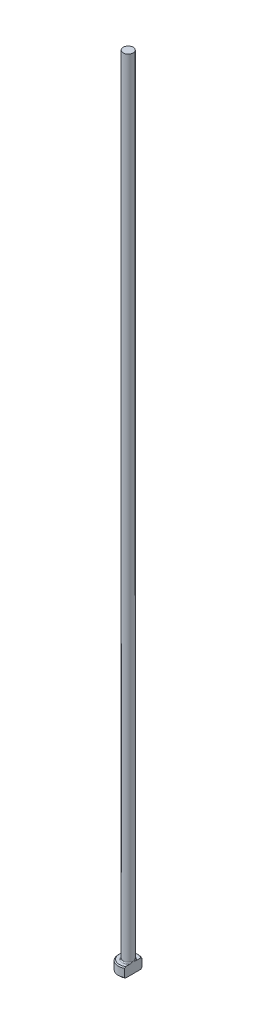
ISO-10303-21;
HEADER;
FILE_DESCRIPTION(('STEP AP214'),'2;1');
FILE_NAME('part.step','',(''),(''),'','','');
FILE_SCHEMA(('AUTOMOTIVE_DESIGN { 1 0 10303 214 1 1 1 1 }'));
ENDSEC;
DATA;
#1=APPLICATION_CONTEXT('core data for automotive mechanical design processes');
#2=APPLICATION_PROTOCOL_DEFINITION('international standard','automotive_design',2000,#1);
#3=PRODUCT_CONTEXT('',#1,'mechanical');
#4=PRODUCT('Part','Part','',(#3));
#5=PRODUCT_RELATED_PRODUCT_CATEGORY('part','',(#4));
#6=PRODUCT_DEFINITION_FORMATION('','',#4);
#7=PRODUCT_DEFINITION_CONTEXT('part definition',#1,'design');
#8=PRODUCT_DEFINITION('design','',#6,#7);
#9=PRODUCT_DEFINITION_SHAPE('','',#8);
#10=(LENGTH_UNIT() NAMED_UNIT(*) SI_UNIT(.MILLI.,.METRE.));
#11=(NAMED_UNIT(*) PLANE_ANGLE_UNIT() SI_UNIT($,.RADIAN.));
#12=(NAMED_UNIT(*) SI_UNIT($,.STERADIAN.) SOLID_ANGLE_UNIT());
#13=UNCERTAINTY_MEASURE_WITH_UNIT(LENGTH_MEASURE(1.E-05),#10,'distance_accuracy_value','');
#14=(GEOMETRIC_REPRESENTATION_CONTEXT(3) GLOBAL_UNCERTAINTY_ASSIGNED_CONTEXT((#13)) GLOBAL_UNIT_ASSIGNED_CONTEXT((#10,
#11,#12)) REPRESENTATION_CONTEXT('',''));
#15=CARTESIAN_POINT('',(0.,0.,0.));
#16=DIRECTION('',(0.,0.,1.));
#17=DIRECTION('',(1.,0.,0.));
#18=AXIS2_PLACEMENT_3D('',#15,#16,#17);
#19=CARTESIAN_POINT('',(0.,0.,0.));
#20=DIRECTION('',(0.,-1.,0.));
#21=DIRECTION('',(0.,0.,-1.));
#22=AXIS2_PLACEMENT_3D('',#19,#20,#21);
#23=PLANE('',#22);
#24=CARTESIAN_POINT('',(0.,0.,0.));
#25=DIRECTION('',(0.,-1.,0.));
#26=DIRECTION('',(0.,0.,-1.));
#27=AXIS2_PLACEMENT_3D('',#24,#25,#26);
#28=CIRCLE('',#27,1.79999999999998);
#29=CARTESIAN_POINT('',(0.999999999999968,0.,1.49666295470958));
#30=VERTEX_POINT('',#29);
#31=CARTESIAN_POINT('',(0.999999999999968,0.,-1.49666295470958));
#32=VERTEX_POINT('',#31);
#33=EDGE_CURVE('E98',#30,#32,#28,.T.);
#34=ORIENTED_EDGE('',*,*,#33,.T.);
#35=DIRECTION('',(0.,0.,1.));
#36=VECTOR('',#35,1.);
#37=CARTESIAN_POINT('',(0.999999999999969,0.,-1.73205080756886));
#38=LINE('',#37,#36);
#39=EDGE_CURVE('E83',#32,#30,#38,.T.);
#40=ORIENTED_EDGE('',*,*,#39,.T.);
#41=EDGE_LOOP('',(#34,#40));
#42=FACE_BOUND('',#41,.T.);
#43=ADVANCED_FACE('F32',(#42),#23,.T.);
#44=CARTESIAN_POINT('',(0.,259.958771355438,0.));
#45=DIRECTION('',(0.,1.,0.));
#46=DIRECTION('',(0.,0.,1.));
#47=AXIS2_PLACEMENT_3D('',#44,#45,#46);
#48=CYLINDRICAL_SURFACE('',#47,1.99999999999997);
#49=CARTESIAN_POINT('',(0.,1.79999999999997,0.));
#50=DIRECTION('',(0.,1.,0.));
#51=DIRECTION('',(0.,0.,1.));
#52=AXIS2_PLACEMENT_3D('',#49,#50,#51);
#53=CIRCLE('',#52,1.99999999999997);
#54=CARTESIAN_POINT('',(0.999999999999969,1.79999999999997,1.73205080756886));
#55=VERTEX_POINT('',#54);
#56=CARTESIAN_POINT('',(0.999999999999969,1.79999999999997,-1.73205080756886));
#57=VERTEX_POINT('',#56);
#58=EDGE_CURVE('E104',#55,#57,#53,.F.);
#59=ORIENTED_EDGE('',*,*,#58,.T.);
#60=DIRECTION('',(0.,-1.,0.));
#61=VECTOR('',#60,1.);
#62=CARTESIAN_POINT('',(0.999999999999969,160.,-1.73205080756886));
#63=LINE('',#62,#61);
#64=CARTESIAN_POINT('',(0.999999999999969,0.199999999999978,-1.73205080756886));
#65=VERTEX_POINT('',#64);
#66=EDGE_CURVE('E183',#57,#65,#63,.T.);
#67=ORIENTED_EDGE('',*,*,#66,.T.);
#68=CARTESIAN_POINT('',(0.,0.199999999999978,0.));
#69=DIRECTION('',(0.,-1.,0.));
#70=DIRECTION('',(0.,0.,-1.));
#71=AXIS2_PLACEMENT_3D('',#68,#69,#70);
#72=CIRCLE('',#71,1.99999999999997);
#73=CARTESIAN_POINT('',(0.999999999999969,0.199999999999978,1.73205080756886));
#74=VERTEX_POINT('',#73);
#75=EDGE_CURVE('E100',#65,#74,#72,.F.);
#76=ORIENTED_EDGE('',*,*,#75,.T.);
#77=DIRECTION('',(0.,-1.,0.));
#78=VECTOR('',#77,1.);
#79=CARTESIAN_POINT('',(0.999999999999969,160.,1.73205080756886));
#80=LINE('',#79,#78);
#81=EDGE_CURVE('E93',#55,#74,#80,.T.);
#82=ORIENTED_EDGE('',*,*,#81,.F.);
#83=EDGE_LOOP('',(#59,#67,#76,#82));
#84=FACE_BOUND('',#83,.T.);
#85=ADVANCED_FACE('F158',(#84),#48,.T.);
#86=CARTESIAN_POINT('',(-1.99999999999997,2.,0.));
#87=DIRECTION('',(0.,1.,0.));
#88=DIRECTION('',(0.,0.,1.));
#89=AXIS2_PLACEMENT_3D('',#86,#87,#88);
#90=PLANE('',#89);
#91=CARTESIAN_POINT('',(0.,2.,0.));
#92=DIRECTION('',(0.,1.,0.));
#93=DIRECTION('',(0.,0.,1.));
#94=AXIS2_PLACEMENT_3D('',#91,#92,#93);
#95=CIRCLE('',#94,1.79999999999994);
#96=CARTESIAN_POINT('',(0.999999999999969,2.,-1.49666295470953));
#97=VERTEX_POINT('',#96);
#98=CARTESIAN_POINT('',(0.999999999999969,2.,1.49666295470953));
#99=VERTEX_POINT('',#98);
#100=EDGE_CURVE('E178',#97,#99,#95,.T.);
#101=ORIENTED_EDGE('',*,*,#100,.T.);
#102=DIRECTION('',(0.,0.,-1.));
#103=VECTOR('',#102,1.);
#104=CARTESIAN_POINT('',(0.999999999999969,2.,0.));
#105=LINE('',#104,#103);
#106=CARTESIAN_POINT('',(0.999999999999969,1.99999999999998,0.66332495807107));
#107=VERTEX_POINT('',#106);
#108=EDGE_CURVE('E57',#99,#107,#105,.T.);
#109=ORIENTED_EDGE('',*,*,#108,.T.);
#110=CARTESIAN_POINT('',(0.,2.,0.));
#111=DIRECTION('',(0.,1.,0.));
#112=DIRECTION('',(0.,0.,1.));
#113=AXIS2_PLACEMENT_3D('',#110,#111,#112);
#114=CIRCLE('',#113,1.19999999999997);
#115=CARTESIAN_POINT('',(0.999999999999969,1.99999999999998,-0.663324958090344));
#116=VERTEX_POINT('',#115);
#117=EDGE_CURVE('E107',#107,#116,#114,.F.);
#118=ORIENTED_EDGE('',*,*,#117,.T.);
#119=EDGE_CURVE('E136',#116,#97,#105,.T.);
#120=ORIENTED_EDGE('',*,*,#119,.T.);
#121=EDGE_LOOP('',(#101,#109,#118,#120));
#122=FACE_BOUND('',#121,.T.);
#123=ADVANCED_FACE('F147',(#122),#90,.T.);
#124=CARTESIAN_POINT('',(0.,2.,0.));
#125=DIRECTION('',(0.,-1.,0.));
#126=DIRECTION('',(0.,0.,-1.));
#127=AXIS2_PLACEMENT_3D('',#124,#125,#126);
#128=CONICAL_SURFACE('',#127,1.79999999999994,0.785398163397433);
#129=ORIENTED_EDGE('',*,*,#58,.F.);
#130=CARTESIAN_POINT('',(0.999999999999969,-0.143084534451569,3.81417299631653));
#131=CARTESIAN_POINT('',(0.999999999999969,-0.059399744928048,3.72765647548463));
#132=CARTESIAN_POINT('',(0.999999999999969,0.0241940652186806,3.64105173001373));
#133=CARTESIAN_POINT('',(0.999999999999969,0.191148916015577,3.46761616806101));
#134=CARTESIAN_POINT('',(0.999999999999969,0.274509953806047,3.38078534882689));
#135=CARTESIAN_POINT('',(0.999999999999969,0.524249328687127,3.11979400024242));
#136=CARTESIAN_POINT('',(0.999999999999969,0.69019863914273,2.94522254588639));
#137=CARTESIAN_POINT('',(0.999999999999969,1.01697550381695,2.59782670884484));
#138=CARTESIAN_POINT('',(0.999999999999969,1.17783928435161,2.42503661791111));
#139=CARTESIAN_POINT('',(0.999999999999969,1.41669118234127,2.16364984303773));
#140=CARTESIAN_POINT('',(0.999999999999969,1.49589273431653,2.07616357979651));
#141=CARTESIAN_POINT('',(0.999999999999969,1.65313803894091,1.90015721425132));
#142=CARTESIAN_POINT('',(0.999999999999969,1.73118183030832,1.81163714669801));
#143=CARTESIAN_POINT('',(0.999999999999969,1.85567318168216,1.66767927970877));
#144=CARTESIAN_POINT('',(0.999999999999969,1.90265415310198,1.61270332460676));
#145=CARTESIAN_POINT('',(0.999999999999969,1.99577882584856,1.50203557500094));
#146=CARTESIAN_POINT('',(0.999999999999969,2.04192244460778,1.44634371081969));
#147=CARTESIAN_POINT('',(0.999999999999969,2.13356596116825,1.33345480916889));
#148=CARTESIAN_POINT('',(0.999999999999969,2.17905399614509,1.2762481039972));
#149=CARTESIAN_POINT('',(0.999999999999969,2.26844283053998,1.16060976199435));
#150=CARTESIAN_POINT('',(0.999999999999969,2.3123437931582,1.10217825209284));
#151=CARTESIAN_POINT('',(0.999999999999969,2.39853453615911,0.982773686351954));
#152=CARTESIAN_POINT('',(0.999999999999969,2.44078986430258,0.921775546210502));
#153=CARTESIAN_POINT('',(0.999999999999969,2.52187810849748,0.797387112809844));
#154=CARTESIAN_POINT('',(0.999999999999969,2.56070631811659,0.733993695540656));
#155=CARTESIAN_POINT('',(0.999999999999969,2.6324859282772,0.604932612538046));
#156=CARTESIAN_POINT('',(0.999999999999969,2.66550424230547,0.539302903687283));
#157=CARTESIAN_POINT('',(0.999999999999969,2.72301550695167,0.404437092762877));
#158=CARTESIAN_POINT('',(0.999999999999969,2.74753707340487,0.335214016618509));
#159=CARTESIAN_POINT('',(0.999999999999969,2.77407110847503,0.231400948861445));
#160=CARTESIAN_POINT('',(0.999999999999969,2.78110742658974,0.198093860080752));
#161=CARTESIAN_POINT('',(0.999999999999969,2.79200506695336,0.130954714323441));
#162=CARTESIAN_POINT('',(0.999999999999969,2.7958666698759,0.0971227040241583));
#163=CARTESIAN_POINT('',(0.999999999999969,2.80013905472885,0.0293410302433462));
#164=CARTESIAN_POINT('',(0.999999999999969,2.80056046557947,-0.00460794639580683));
#165=CARTESIAN_POINT('',(0.999999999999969,2.79795882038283,-0.0723663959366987));
#166=CARTESIAN_POINT('',(0.999999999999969,2.79493547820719,-0.106175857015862));
#167=CARTESIAN_POINT('',(0.999999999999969,2.78105481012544,-0.206326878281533));
#168=CARTESIAN_POINT('',(0.999999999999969,2.76542146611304,-0.272037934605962));
#169=CARTESIAN_POINT('',(0.999999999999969,2.73477554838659,-0.368312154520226));
#170=CARTESIAN_POINT('',(0.999999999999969,2.72331063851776,-0.400123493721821));
#171=CARTESIAN_POINT('',(0.999999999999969,2.69840546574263,-0.46296441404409));
#172=CARTESIAN_POINT('',(0.999999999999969,2.68496560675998,-0.493994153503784));
#173=CARTESIAN_POINT('',(0.999999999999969,2.64209309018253,-0.586298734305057));
#174=CARTESIAN_POINT('',(0.999999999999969,2.61022871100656,-0.64643570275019));
#175=CARTESIAN_POINT('',(0.999999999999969,2.5422853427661,-0.764304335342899));
#176=CARTESIAN_POINT('',(0.999999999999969,2.50620119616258,-0.822032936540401));
#177=CARTESIAN_POINT('',(0.999999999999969,2.43107084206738,-0.935840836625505));
#178=CARTESIAN_POINT('',(0.999999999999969,2.39201347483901,-0.99191270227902));
#179=CARTESIAN_POINT('',(0.999999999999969,2.31195870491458,-1.10259849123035));
#180=CARTESIAN_POINT('',(0.999999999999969,2.27096226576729,-1.15721311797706));
#181=CARTESIAN_POINT('',(0.999999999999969,2.18701695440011,-1.26606869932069));
#182=CARTESIAN_POINT('',(0.999999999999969,2.14404946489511,-1.32029522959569));
#183=CARTESIAN_POINT('',(0.999999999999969,2.0570505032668,-1.4278898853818));
#184=CARTESIAN_POINT('',(0.999999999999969,2.01301896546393,-1.48125795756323));
#185=CARTESIAN_POINT('',(0.999999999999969,1.87995068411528,-1.64010952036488));
#186=CARTESIAN_POINT('',(0.999999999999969,1.78973357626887,-1.74460261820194));
#187=CARTESIAN_POINT('',(0.999999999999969,1.62290341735,-1.93426834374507));
#188=CARTESIAN_POINT('',(0.999999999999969,1.54658658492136,-2.01970404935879));
#189=CARTESIAN_POINT('',(0.999999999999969,1.39301250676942,-2.18973019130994));
#190=CARTESIAN_POINT('',(0.999999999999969,1.31575523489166,-2.27432060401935));
#191=CARTESIAN_POINT('',(0.999999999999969,1.08283440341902,-2.52732479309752));
#192=CARTESIAN_POINT('',(0.999999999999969,0.926165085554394,-2.69481086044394));
#193=CARTESIAN_POINT('',(0.999999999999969,0.617772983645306,-3.02147252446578));
#194=CARTESIAN_POINT('',(0.999999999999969,0.466111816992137,-3.18070657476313));
#195=CARTESIAN_POINT('',(0.999999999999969,0.23801507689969,-3.41880818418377));
#196=CARTESIAN_POINT('',(0.999999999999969,0.161924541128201,-3.49800657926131));
#197=CARTESIAN_POINT('',(0.999999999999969,0.00955322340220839,-3.65621892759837));
#198=CARTESIAN_POINT('',(0.999999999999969,-0.0667275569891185,-3.73523288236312));
#199=CARTESIAN_POINT('',(0.999999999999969,-0.143084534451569,-3.81417299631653));
#200=B_SPLINE_CURVE_WITH_KNOTS('',3,(#130,#131,#132,#133,#134,#135,#136,#137,#138,#139,#140,
#141,#142,#143,#144,#145,#146,#147,#148,#149,#150,#151,#152,#153,#154,#155,#156,#157,#158,#159,
#160,#161,#162,#163,#164,#165,#166,#167,#168,#169,#170,#171,#172,#173,#174,#175,#176,#177,#178,
#179,#180,#181,#182,#183,#184,#185,#186,#187,#188,#189,#190,#191,#192,#193,#194,#195,#196,#197,
#198,#199),.UNSPECIFIED.,.F.,.F.,(4,2,2,2,2,2,2,2,2,2,2,2,2,2,2,2,2,2,2,2,2,2,2,2,2,2,2,2,2,2,2,
2,2,2,4),(0.,0.361101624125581,0.722207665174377,1.44478731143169,2.15299784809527,
2.50702638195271,2.8610430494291,3.07798416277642,3.29494655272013,3.51418925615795,
3.73340935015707,3.95594813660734,4.17878792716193,4.39886399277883,4.61819150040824,
4.72018864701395,4.82217677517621,4.92384967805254,5.02553102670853,5.22698459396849,
5.32838854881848,5.4297717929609,5.63365200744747,5.837784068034,6.04272417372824,
6.24756349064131,6.45510395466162,6.66265726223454,7.07676259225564,7.42043039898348,
7.7641077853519,8.45210822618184,9.1118082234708,9.44129145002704,9.77077197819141),.UNSPECIFIED.);
#201=EDGE_CURVE('E135',#55,#99,#200,.T.);
#202=ORIENTED_EDGE('',*,*,#201,.T.);
#203=ORIENTED_EDGE('',*,*,#100,.F.);
#204=EDGE_CURVE('E127',#97,#57,#200,.T.);
#205=ORIENTED_EDGE('',*,*,#204,.T.);
#206=EDGE_LOOP('',(#129,#202,#203,#205));
#207=FACE_BOUND('',#206,.T.);
#208=ADVANCED_FACE('F143',(#207),#128,.T.);
#209=CARTESIAN_POINT('',(0.,0.199999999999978,0.));
#210=DIRECTION('',(0.,1.,0.));
#211=DIRECTION('',(0.,0.,1.));
#212=AXIS2_PLACEMENT_3D('',#209,#210,#211);
#213=CONICAL_SURFACE('',#212,1.99999999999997,0.785398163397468);
#214=ORIENTED_EDGE('',*,*,#75,.F.);
#215=CARTESIAN_POINT('',(0.999999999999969,2.14308453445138,-3.81417299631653));
#216=CARTESIAN_POINT('',(0.999999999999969,2.05939974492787,-3.72765647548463));
#217=CARTESIAN_POINT('',(0.999999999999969,1.97580593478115,-3.64105173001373));
#218=CARTESIAN_POINT('',(0.999999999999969,1.80885108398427,-3.46761616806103));
#219=CARTESIAN_POINT('',(0.999999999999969,1.72549004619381,-3.38078534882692));
#220=CARTESIAN_POINT('',(0.999999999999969,1.47575067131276,-3.11979400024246));
#221=CARTESIAN_POINT('',(0.999999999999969,1.30980136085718,-2.94522254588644));
#222=CARTESIAN_POINT('',(0.999999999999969,0.983024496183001,-2.5978267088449));
#223=CARTESIAN_POINT('',(0.999999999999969,0.822160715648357,-2.42503661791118));
#224=CARTESIAN_POINT('',(0.999999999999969,0.583308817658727,-2.16364984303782));
#225=CARTESIAN_POINT('',(0.999999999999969,0.504107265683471,-2.0761635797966));
#226=CARTESIAN_POINT('',(0.999999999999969,0.346861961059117,-1.90015721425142));
#227=CARTESIAN_POINT('',(0.999999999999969,0.26881816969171,-1.81163714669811));
#228=CARTESIAN_POINT('',(0.999999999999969,0.144326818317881,-1.66767927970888));
#229=CARTESIAN_POINT('',(0.999999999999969,0.0973458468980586,-1.61270332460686));
#230=CARTESIAN_POINT('',(0.999999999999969,0.00422117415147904,-1.50203557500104));
#231=CARTESIAN_POINT('',(0.999999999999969,-0.0419224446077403,-1.44634371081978));
#232=CARTESIAN_POINT('',(0.999999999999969,-0.13356596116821,-1.33345480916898));
#233=CARTESIAN_POINT('',(0.999999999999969,-0.179053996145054,-1.27624810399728));
#234=CARTESIAN_POINT('',(0.999999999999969,-0.268442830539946,-1.16060976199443));
#235=CARTESIAN_POINT('',(0.999999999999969,-0.312343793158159,-1.10217825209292));
#236=CARTESIAN_POINT('',(0.999999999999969,-0.398534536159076,-0.982773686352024));
#237=CARTESIAN_POINT('',(0.999999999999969,-0.440789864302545,-0.92177554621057));
#238=CARTESIAN_POINT('',(0.999999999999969,-0.521878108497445,-0.797387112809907));
#239=CARTESIAN_POINT('',(0.999999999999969,-0.560706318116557,-0.733993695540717));
#240=CARTESIAN_POINT('',(0.999999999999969,-0.632485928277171,-0.604932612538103));
#241=CARTESIAN_POINT('',(0.999999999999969,-0.66550424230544,-0.539302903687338));
#242=CARTESIAN_POINT('',(0.999999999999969,-0.723015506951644,-0.404437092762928));
#243=CARTESIAN_POINT('',(0.999999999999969,-0.747537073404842,-0.335214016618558));
#244=CARTESIAN_POINT('',(0.999999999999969,-0.774071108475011,-0.231400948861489));
#245=CARTESIAN_POINT('',(0.999999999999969,-0.781107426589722,-0.198093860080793));
#246=CARTESIAN_POINT('',(0.999999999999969,-0.792005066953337,-0.130954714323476));
#247=CARTESIAN_POINT('',(0.999999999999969,-0.795866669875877,-0.0971227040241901));
#248=CARTESIAN_POINT('',(0.999999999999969,-0.80013905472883,-0.0293410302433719));
#249=CARTESIAN_POINT('',(0.999999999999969,-0.80056046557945,0.00460794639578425));
#250=CARTESIAN_POINT('',(0.999999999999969,-0.797958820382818,0.0723663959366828));
#251=CARTESIAN_POINT('',(0.999999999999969,-0.794935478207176,0.106175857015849));
#252=CARTESIAN_POINT('',(0.999999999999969,-0.781054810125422,0.20632687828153));
#253=CARTESIAN_POINT('',(0.999999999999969,-0.765421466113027,0.272037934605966));
#254=CARTESIAN_POINT('',(0.999999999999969,-0.734775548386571,0.36831215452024));
#255=CARTESIAN_POINT('',(0.999999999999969,-0.723310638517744,0.400123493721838));
#256=CARTESIAN_POINT('',(0.999999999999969,-0.698405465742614,0.462964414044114));
#257=CARTESIAN_POINT('',(0.999999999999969,-0.684965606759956,0.493994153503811));
#258=CARTESIAN_POINT('',(0.999999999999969,-0.642093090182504,0.586298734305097));
#259=CARTESIAN_POINT('',(0.999999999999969,-0.610228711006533,0.64643570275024));
#260=CARTESIAN_POINT('',(0.999999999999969,-0.542285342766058,0.764304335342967));
#261=CARTESIAN_POINT('',(0.999999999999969,-0.506201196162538,0.822032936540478));
#262=CARTESIAN_POINT('',(0.999999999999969,-0.431070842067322,0.9358408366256));
#263=CARTESIAN_POINT('',(0.999999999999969,-0.392013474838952,0.991912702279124));
#264=CARTESIAN_POINT('',(0.999999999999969,-0.311958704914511,1.10259849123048));
#265=CARTESIAN_POINT('',(0.999999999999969,-0.270962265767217,1.15721311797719));
#266=CARTESIAN_POINT('',(0.999999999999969,-0.187016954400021,1.26606869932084));
#267=CARTESIAN_POINT('',(0.999999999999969,-0.144049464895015,1.32029522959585));
#268=CARTESIAN_POINT('',(0.999999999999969,-0.0570505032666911,1.42788988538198));
#269=CARTESIAN_POINT('',(0.999999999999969,-0.0130189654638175,1.48125795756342));
#270=CARTESIAN_POINT('',(0.999999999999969,0.120049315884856,1.6401095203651));
#271=CARTESIAN_POINT('',(0.999999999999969,0.210266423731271,1.74460261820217));
#272=CARTESIAN_POINT('',(0.999999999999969,0.377096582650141,1.93426834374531));
#273=CARTESIAN_POINT('',(0.999999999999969,0.453413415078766,2.01970404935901));
#274=CARTESIAN_POINT('',(0.999999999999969,0.606987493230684,2.18973019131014));
#275=CARTESIAN_POINT('',(0.999999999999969,0.684244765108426,2.27432060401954));
#276=CARTESIAN_POINT('',(0.999999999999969,0.917165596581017,2.52732479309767));
#277=CARTESIAN_POINT('',(0.999999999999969,1.07383491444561,2.69481086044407));
#278=CARTESIAN_POINT('',(0.999999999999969,1.38222701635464,3.02147252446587));
#279=CARTESIAN_POINT('',(0.999999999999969,1.53388818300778,3.1807065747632));
#280=CARTESIAN_POINT('',(0.999999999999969,1.76198492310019,3.41880818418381));
#281=CARTESIAN_POINT('',(0.999999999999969,1.83807545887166,3.49800657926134));
#282=CARTESIAN_POINT('',(0.999999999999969,1.99044677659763,3.65621892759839));
#283=CARTESIAN_POINT('',(0.999999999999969,2.06672755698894,3.73523288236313));
#284=CARTESIAN_POINT('',(0.999999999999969,2.14308453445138,3.81417299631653));
#285=B_SPLINE_CURVE_WITH_KNOTS('',3,(#215,#216,#217,#218,#219,#220,#221,#222,#223,#224,#225,
#226,#227,#228,#229,#230,#231,#232,#233,#234,#235,#236,#237,#238,#239,#240,#241,#242,#243,#244,
#245,#246,#247,#248,#249,#250,#251,#252,#253,#254,#255,#256,#257,#258,#259,#260,#261,#262,#263,
#264,#265,#266,#267,#268,#269,#270,#271,#272,#273,#274,#275,#276,#277,#278,#279,#280,#281,#282,
#283,#284),.UNSPECIFIED.,.F.,.F.,(4,2,2,2,2,2,2,2,2,2,2,2,2,2,2,2,2,2,2,2,2,2,2,2,2,2,2,2,2,2,2,
2,2,2,4),(0.,0.36110162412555,0.722207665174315,1.44478731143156,2.15299784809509,
2.5070263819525,2.86104304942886,3.07798416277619,3.2949465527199,3.51418925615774,
3.73340935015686,3.95594813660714,4.17878792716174,4.39886399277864,4.61819150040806,
4.72018864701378,4.82217677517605,4.92384967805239,5.02553102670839,5.22698459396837,
5.32838854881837,5.42977179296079,5.6336520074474,5.83778406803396,6.04272417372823,
6.24756349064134,6.45510395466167,6.66265726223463,7.07676259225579,7.42043039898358,
7.76410778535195,8.45210822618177,9.11180822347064,9.44129145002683,9.77077197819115),.UNSPECIFIED.);
#286=EDGE_CURVE('E86',#65,#32,#285,.T.);
#287=ORIENTED_EDGE('',*,*,#286,.T.);
#288=ORIENTED_EDGE('',*,*,#33,.F.);
#289=EDGE_CURVE('E89',#30,#74,#285,.T.);
#290=ORIENTED_EDGE('',*,*,#289,.T.);
#291=EDGE_LOOP('',(#214,#287,#288,#290));
#292=FACE_BOUND('',#291,.T.);
#293=ADVANCED_FACE('F97',(#292),#213,.T.);
#294=CARTESIAN_POINT('',(0.,2.19999999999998,0.));
#295=DIRECTION('',(0.,1.,0.));
#296=DIRECTION('',(0.,0.,1.));
#297=AXIS2_PLACEMENT_3D('',#294,#295,#296);
#298=TOROIDAL_SURFACE('',#297,1.19999999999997,0.2);
#299=CARTESIAN_POINT('',(0.999999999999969,2.19999999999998,0.));
#300=CARTESIAN_POINT('',(0.999999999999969,2.20000051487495,2.59077200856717E-12));
#301=CARTESIAN_POINT('',(0.999999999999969,2.20000102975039,-9.42496325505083E-08));
#302=CARTESIAN_POINT('',(0.999999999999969,2.20000202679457,-4.00799841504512E-07));
#303=CARTESIAN_POINT('',(0.999999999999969,2.20000250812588,-6.15372268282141E-07));
#304=CARTESIAN_POINT('',(0.999999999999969,2.20000346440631,-1.13351400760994E-06));
#305=CARTESIAN_POINT('',(0.999999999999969,2.20000393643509,-1.44235223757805E-06));
#306=CARTESIAN_POINT('',(0.999999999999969,2.20000483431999,-2.11388875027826E-06));
#307=CARTESIAN_POINT('',(0.999999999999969,2.20000526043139,-2.47625951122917E-06));
#308=CARTESIAN_POINT('',(0.999999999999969,2.20000666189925,-3.75794156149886E-06));
#309=CARTESIAN_POINT('',(0.999999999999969,2.20000757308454,-4.74818955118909E-06));
#310=CARTESIAN_POINT('',(0.999999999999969,2.20000922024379,-6.81289830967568E-06));
#311=CARTESIAN_POINT('',(0.999999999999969,2.20000996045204,-7.88417644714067E-06));
#312=CARTESIAN_POINT('',(0.999999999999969,2.20001267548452,-1.19907293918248E-05));
#313=CARTESIAN_POINT('',(0.999999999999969,2.20001450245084,-1.51274184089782E-05));
#314=CARTESIAN_POINT('',(0.999999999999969,2.20001755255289,-2.1371542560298E-05));
#315=CARTESIAN_POINT('',(0.999999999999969,2.20001881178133,-2.44620176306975E-05));
#316=CARTESIAN_POINT('',(0.999999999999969,2.20002404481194,-3.74145208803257E-05));
#317=CARTESIAN_POINT('',(0.999999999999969,2.20002793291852,-4.73052124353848E-05));
#318=CARTESIAN_POINT('',(0.999999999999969,2.2000342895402,-6.59457075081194E-05));
#319=CARTESIAN_POINT('',(0.999999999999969,2.2000368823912,-7.46515299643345E-05));
#320=CARTESIAN_POINT('',(0.999999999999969,2.20005709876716,-0.00013702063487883));
#321=CARTESIAN_POINT('',(0.999999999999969,2.20008244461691,-0.000187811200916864));
#322=CARTESIAN_POINT('',(0.999999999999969,2.20017671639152,-0.000384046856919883));
#323=CARTESIAN_POINT('',(0.999999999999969,2.20023990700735,-0.000531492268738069));
#324=CARTESIAN_POINT('',(0.999999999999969,2.20048701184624,-0.00109942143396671));
#325=CARTESIAN_POINT('',(0.999999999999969,2.20067693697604,-0.00151784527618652));
#326=CARTESIAN_POINT('',(0.999999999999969,2.20144296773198,-0.00321386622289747));
#327=CARTESIAN_POINT('',(0.999999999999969,2.20201230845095,-0.00449374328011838));
#328=CARTESIAN_POINT('',(0.999999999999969,2.20998444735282,-0.0224047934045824));
#329=CARTESIAN_POINT('',(0.999999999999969,2.2174352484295,-0.0390202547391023));
#330=CARTESIAN_POINT('',(0.999999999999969,2.2319700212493,-0.0717084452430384));
#331=CARTESIAN_POINT('',(0.999999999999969,2.23905766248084,-0.0877796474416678));
#332=CARTESIAN_POINT('',(0.999999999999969,2.25389009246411,-0.121781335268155));
#333=CARTESIAN_POINT('',(0.999999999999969,2.26161964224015,-0.139718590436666));
#334=CARTESIAN_POINT('',(0.999999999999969,2.27689168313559,-0.175878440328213));
#335=CARTESIAN_POINT('',(0.999999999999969,2.28443162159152,-0.194102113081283));
#336=CARTESIAN_POINT('',(0.999999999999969,2.30282726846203,-0.239840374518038));
#337=CARTESIAN_POINT('',(0.999999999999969,2.31345710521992,-0.267447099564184));
#338=CARTESIAN_POINT('',(0.999999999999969,2.33331094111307,-0.322481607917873));
#339=CARTESIAN_POINT('',(0.999999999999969,2.34256072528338,-0.349899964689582));
#340=CARTESIAN_POINT('',(0.999999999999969,2.35732089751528,-0.398044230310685));
#341=CARTESIAN_POINT('',(0.999999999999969,2.36317895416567,-0.41866173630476));
#342=CARTESIAN_POINT('',(0.999999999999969,2.37387907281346,-0.460275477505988));
#343=CARTESIAN_POINT('',(0.999999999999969,2.37871519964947,-0.481273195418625));
#344=CARTESIAN_POINT('',(0.999999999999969,2.39174175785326,-0.546853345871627));
#345=CARTESIAN_POINT('',(0.999999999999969,2.39776253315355,-0.591947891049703));
#346=CARTESIAN_POINT('',(0.999999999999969,2.40040174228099,-0.660990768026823));
#347=CARTESIAN_POINT('',(0.999999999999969,2.400126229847,-0.684818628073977));
#348=CARTESIAN_POINT('',(0.999999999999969,2.39660783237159,-0.732027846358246));
#349=CARTESIAN_POINT('',(0.999999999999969,2.39339826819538,-0.755411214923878));
#350=CARTESIAN_POINT('',(0.999999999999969,2.38447874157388,-0.796083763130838));
#351=CARTESIAN_POINT('',(0.999999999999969,2.37951676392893,-0.813533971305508));
#352=CARTESIAN_POINT('',(0.999999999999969,2.36698902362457,-0.84753143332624));
#353=CARTESIAN_POINT('',(0.999999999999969,2.35942232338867,-0.864078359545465));
#354=CARTESIAN_POINT('',(0.999999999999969,2.34431787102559,-0.89014154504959));
#355=CARTESIAN_POINT('',(0.999999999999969,2.33762931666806,-0.900148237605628));
#356=CARTESIAN_POINT('',(0.999999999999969,2.32281345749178,-0.9190336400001));
#357=CARTESIAN_POINT('',(0.999999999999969,2.3146887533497,-0.927914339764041));
#358=CARTESIAN_POINT('',(0.999999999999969,2.29878569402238,-0.942427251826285));
#359=CARTESIAN_POINT('',(0.999999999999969,2.29127620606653,-0.948352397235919));
#360=CARTESIAN_POINT('',(0.999999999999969,2.27538509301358,-0.958904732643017));
#361=CARTESIAN_POINT('',(0.999999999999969,2.26700378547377,-0.963532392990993));
#362=CARTESIAN_POINT('',(0.999999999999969,2.24944905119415,-0.971220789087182));
#363=CARTESIAN_POINT('',(0.999999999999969,2.24026913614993,-0.974266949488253));
#364=CARTESIAN_POINT('',(0.999999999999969,2.22148612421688,-0.978466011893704));
#365=CARTESIAN_POINT('',(0.999999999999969,2.21188346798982,-0.979620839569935));
#366=CARTESIAN_POINT('',(0.999999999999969,2.19406751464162,-0.979911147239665));
#367=CARTESIAN_POINT('',(0.999999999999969,2.18585759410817,-0.979318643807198));
#368=CARTESIAN_POINT('',(0.999999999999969,2.16966497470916,-0.976727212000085));
#369=CARTESIAN_POINT('',(0.999999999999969,2.16168225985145,-0.974728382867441));
#370=CARTESIAN_POINT('',(0.999999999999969,2.14632905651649,-0.969513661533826));
#371=CARTESIAN_POINT('',(0.999999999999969,2.13894889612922,-0.966325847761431));
#372=CARTESIAN_POINT('',(0.999999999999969,2.12474145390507,-0.958901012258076));
#373=CARTESIAN_POINT('',(0.999999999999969,2.11791436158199,-0.954663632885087));
#374=CARTESIAN_POINT('',(0.999999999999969,2.10210888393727,-0.943323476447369));
#375=CARTESIAN_POINT('',(0.999999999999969,2.09345388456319,-0.935769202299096));
#376=CARTESIAN_POINT('',(0.999999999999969,2.07747441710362,-0.919359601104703));
#377=CARTESIAN_POINT('',(0.999999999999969,2.07015330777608,-0.910501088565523));
#378=CARTESIAN_POINT('',(0.999999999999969,2.05394486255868,-0.887884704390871));
#379=CARTESIAN_POINT('',(0.999999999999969,2.04572469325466,-0.873650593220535));
#380=CARTESIAN_POINT('',(0.999999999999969,2.03162462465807,-0.844119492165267));
#381=CARTESIAN_POINT('',(0.999999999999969,2.02574383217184,-0.828822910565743));
#382=CARTESIAN_POINT('',(0.999999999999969,2.01314628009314,-0.78860523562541));
#383=CARTESIAN_POINT('',(0.999999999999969,2.00790637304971,-0.763225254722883));
#384=CARTESIAN_POINT('',(0.999999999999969,2.00123778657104,-0.711706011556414));
#385=CARTESIAN_POINT('',(0.999999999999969,1.99986086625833,-0.685561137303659));
#386=CARTESIAN_POINT('',(0.999999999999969,2.00029138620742,-0.610897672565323));
#387=CARTESIAN_POINT('',(0.999999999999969,2.00583944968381,-0.562408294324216));
#388=CARTESIAN_POINT('',(0.999999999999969,2.01894675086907,-0.492015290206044));
#389=CARTESIAN_POINT('',(0.999999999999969,2.02392178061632,-0.469516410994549));
#390=CARTESIAN_POINT('',(0.999999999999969,2.03507986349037,-0.424950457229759));
#391=CARTESIAN_POINT('',(0.999999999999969,2.04125559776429,-0.402881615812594));
#392=CARTESIAN_POINT('',(0.999999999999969,2.05640318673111,-0.353063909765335));
#393=CARTESIAN_POINT('',(0.999999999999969,2.06567810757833,-0.325409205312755));
#394=CARTESIAN_POINT('',(0.999999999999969,2.08561584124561,-0.269900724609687));
#395=CARTESIAN_POINT('',(0.999999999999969,2.0963053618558,-0.242056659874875));
#396=CARTESIAN_POINT('',(0.999999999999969,2.11482832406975,-0.195905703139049));
#397=CARTESIAN_POINT('',(0.999999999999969,2.12243033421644,-0.177504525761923));
#398=CARTESIAN_POINT('',(0.999999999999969,2.13783353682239,-0.140994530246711));
#399=CARTESIAN_POINT('',(0.999999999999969,2.1456321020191,-0.122884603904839));
#400=CARTESIAN_POINT('',(0.999999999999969,2.16059970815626,-0.0885577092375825));
#401=CARTESIAN_POINT('',(0.999999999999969,2.16775305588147,-0.0723337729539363));
#402=CARTESIAN_POINT('',(0.999999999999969,2.18242403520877,-0.0393353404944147));
#403=CARTESIAN_POINT('',(0.999999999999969,2.18994542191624,-0.0225624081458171));
#404=CARTESIAN_POINT('',(0.999999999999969,2.19798770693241,-0.00449370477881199));
#405=CARTESIAN_POINT('',(0.999999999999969,2.19855706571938,-0.00321379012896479));
#406=CARTESIAN_POINT('',(0.999999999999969,2.19932310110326,-0.00151776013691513));
#407=CARTESIAN_POINT('',(0.999999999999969,2.1995130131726,-0.00109936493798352));
#408=CARTESIAN_POINT('',(0.999999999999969,2.19976010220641,-0.000531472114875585));
#409=CARTESIAN_POINT('',(0.999999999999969,2.19982328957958,-0.000384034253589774));
#410=CARTESIAN_POINT('',(0.999999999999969,2.19991755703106,-0.000187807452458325));
#411=CARTESIAN_POINT('',(0.999999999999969,2.19994290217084,-0.00013701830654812));
#412=CARTESIAN_POINT('',(0.999999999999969,2.19996311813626,-7.46508463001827E-05));
#413=CARTESIAN_POINT('',(0.999999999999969,2.19996571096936,-6.59451379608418E-05));
#414=CARTESIAN_POINT('',(0.999999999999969,2.19997206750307,-4.73048898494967E-05));
#415=CARTESIAN_POINT('',(0.999999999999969,2.1999759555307,-3.74143280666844E-05));
#416=CARTESIAN_POINT('',(0.999999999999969,2.19998118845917,-2.44619706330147E-05));
#417=CARTESIAN_POINT('',(0.999999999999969,2.19998244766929,-2.13715141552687E-05));
#418=CARTESIAN_POINT('',(0.999999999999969,2.199985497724,-1.51274243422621E-05));
#419=CARTESIAN_POINT('',(0.999999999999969,2.19998732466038,-1.19907504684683E-05));
#420=CARTESIAN_POINT('',(0.999999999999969,2.1999900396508,-7.88421137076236E-06));
#421=CARTESIAN_POINT('',(0.999999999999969,2.19999077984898,-6.81293469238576E-06));
#422=CARTESIAN_POINT('',(0.999999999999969,2.19999242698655,-4.74822681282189E-06));
#423=CARTESIAN_POINT('',(0.999999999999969,2.19999333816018,-3.75797816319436E-06));
#424=CARTESIAN_POINT('',(0.999999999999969,2.19999473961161,-2.47629275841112E-06));
#425=CARTESIAN_POINT('',(0.999999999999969,2.19999516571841,-2.11392054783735E-06));
#426=CARTESIAN_POINT('',(0.999999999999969,2.1999960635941,-1.44238031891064E-06));
#427=CARTESIAN_POINT('',(0.999999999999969,2.19999653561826,-1.13353981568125E-06));
#428=CARTESIAN_POINT('',(0.999999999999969,2.19999749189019,-6.15392568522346E-07));
#429=CARTESIAN_POINT('',(0.999999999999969,2.1999979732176,-4.00816998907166E-07));
#430=CARTESIAN_POINT('',(0.999999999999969,2.19999897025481,-9.42592107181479E-08));
#431=CARTESIAN_POINT('',(0.999999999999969,2.19999948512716,-2.59076122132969E-12));
#432=CARTESIAN_POINT('',(0.999999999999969,2.19999999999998,0.));
#433=B_SPLINE_CURVE_WITH_KNOTS('',3,(#299,#300,#301,#302,#303,#304,#305,#306,#307,#308,#309,
#310,#311,#312,#313,#314,#315,#316,#317,#318,#319,#320,#321,#322,#323,#324,#325,#326,#327,#328,
#329,#330,#331,#332,#333,#334,#335,#336,#337,#338,#339,#340,#341,#342,#343,#344,#345,#346,#347,
#348,#349,#350,#351,#352,#353,#354,#355,#356,#357,#358,#359,#360,#361,#362,#363,#364,#365,#366,
#367,#368,#369,#370,#371,#372,#373,#374,#375,#376,#377,#378,#379,#380,#381,#382,#383,#384,#385,
#386,#387,#388,#389,#390,#391,#392,#393,#394,#395,#396,#397,#398,#399,#400,#401,#402,#403,#404,
#405,#406,#407,#408,#409,#410,#411,#412,#413,#414,#415,#416,#417,#418,#419,#420,#421,#422,#423,
#424,#425,#426,#427,#428,#429,#430,#431,#432),.UNSPECIFIED.,.T.,.F.,(4,2,2,2,2,2,2,2,2,2,2,2,2,
2,2,2,2,2,2,2,2,2,2,2,2,2,2,2,2,2,2,2,2,2,2,2,2,2,2,2,2,2,2,2,2,2,2,2,2,2,2,2,2,2,2,2,2,2,2,2,2,
2,2,2,2,2,4),(0.,1.54318097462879E-06,3.11656716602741E-06,4.80252030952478E-06,
6.47855574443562E-06,1.04956563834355E-05,1.43988918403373E-05,2.52504396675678E-05,
3.5251842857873E-05,6.71249460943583E-05,9.4349675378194E-05,0.0002638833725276,
0.000745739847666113,0.00212351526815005,0.00632669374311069,0.060948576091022,0.11364394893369,
0.172237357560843,0.23140101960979,0.32012930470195,0.406905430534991,0.471177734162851,
0.535813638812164,0.67161710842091,0.742973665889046,0.813529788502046,0.867802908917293,
0.922095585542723,0.958095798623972,0.994031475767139,1.02261929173,1.05119673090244,
1.08003306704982,1.10884002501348,1.13341017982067,1.15797860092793,1.18200020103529,
1.20602999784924,1.24030227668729,1.27465969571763,1.32369575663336,1.37271307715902,
1.4500242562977,1.52836647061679,1.67385288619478,1.74297459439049,1.81168748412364,
1.89915940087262,1.9886152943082,2.04834216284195,2.10749314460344,2.16068730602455,
2.21582681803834,2.2200301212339,2.22140780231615,2.2218896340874,2.22205916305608,
2.22208638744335,2.22211826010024,2.22212826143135,2.22213911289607,2.2221430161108,
2.22214703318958,2.22214870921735,2.22215039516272,2.22215196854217,2.22215351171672),.UNSPECIFIED.);
#434=CARTESIAN_POINT('',(0.999999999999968,2.19999999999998,0.));
#435=VERTEX_POINT('',#434);
#436=EDGE_CURVE('E11',#116,#435,#433,.T.);
#437=ORIENTED_EDGE('',*,*,#436,.F.);
#438=ORIENTED_EDGE('',*,*,#117,.F.);
#439=CARTESIAN_POINT('',(0.999999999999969,2.19999999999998,0.));
#440=CARTESIAN_POINT('',(0.999999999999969,2.19999948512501,-2.59076884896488E-12));
#441=CARTESIAN_POINT('',(0.999999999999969,2.19999897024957,9.42496325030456E-08));
#442=CARTESIAN_POINT('',(0.999999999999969,2.19999797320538,4.00799841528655E-07));
#443=CARTESIAN_POINT('',(0.999999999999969,2.19999749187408,6.15372268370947E-07));
#444=CARTESIAN_POINT('',(0.999999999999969,2.19999653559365,1.1335140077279E-06));
#445=CARTESIAN_POINT('',(0.999999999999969,2.19999606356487,1.44235223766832E-06));
#446=CARTESIAN_POINT('',(0.999999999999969,2.19999516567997,2.11388875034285E-06));
#447=CARTESIAN_POINT('',(0.999999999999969,2.19999473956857,2.47625951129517E-06));
#448=CARTESIAN_POINT('',(0.999999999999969,2.19999333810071,3.75794156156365E-06));
#449=CARTESIAN_POINT('',(0.999999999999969,2.19999242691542,4.74818955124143E-06));
#450=CARTESIAN_POINT('',(0.999999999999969,2.19999077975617,6.81289830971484E-06));
#451=CARTESIAN_POINT('',(0.999999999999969,2.19999003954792,7.88417644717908E-06));
#452=CARTESIAN_POINT('',(0.999999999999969,2.19998732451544,1.19907293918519E-05));
#453=CARTESIAN_POINT('',(0.999999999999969,2.19998549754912,1.51274184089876E-05));
#454=CARTESIAN_POINT('',(0.999999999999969,2.19998244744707,2.13715425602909E-05));
#455=CARTESIAN_POINT('',(0.999999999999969,2.19998118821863,2.44620176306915E-05));
#456=CARTESIAN_POINT('',(0.999999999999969,2.19997595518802,3.74145208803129E-05));
#457=CARTESIAN_POINT('',(0.999999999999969,2.19997206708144,4.7305212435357E-05));
#458=CARTESIAN_POINT('',(0.999999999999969,2.19996571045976,6.59457075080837E-05));
#459=CARTESIAN_POINT('',(0.999999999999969,2.19996311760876,7.46515299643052E-05));
#460=CARTESIAN_POINT('',(0.999999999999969,2.1999429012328,0.000137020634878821));
#461=CARTESIAN_POINT('',(0.999999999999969,2.19991755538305,0.000187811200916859));
#462=CARTESIAN_POINT('',(0.999999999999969,2.19982328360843,0.000384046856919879));
#463=CARTESIAN_POINT('',(0.999999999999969,2.19976009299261,0.000531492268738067));
#464=CARTESIAN_POINT('',(0.999999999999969,2.19951298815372,0.00109942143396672));
#465=CARTESIAN_POINT('',(0.999999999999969,2.19932306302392,0.00151784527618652));
#466=CARTESIAN_POINT('',(0.999999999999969,2.19855703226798,0.00321386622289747));
#467=CARTESIAN_POINT('',(0.999999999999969,2.19798769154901,0.00449374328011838));
#468=CARTESIAN_POINT('',(0.999999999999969,2.19001555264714,0.0224047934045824));
#469=CARTESIAN_POINT('',(0.999999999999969,2.18256475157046,0.0390202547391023));
#470=CARTESIAN_POINT('',(0.999999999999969,2.16802997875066,0.0717084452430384));
#471=CARTESIAN_POINT('',(0.999999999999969,2.16094233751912,0.0877796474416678));
#472=CARTESIAN_POINT('',(0.999999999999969,2.14610990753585,0.121781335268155));
#473=CARTESIAN_POINT('',(0.999999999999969,2.13838035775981,0.139718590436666));
#474=CARTESIAN_POINT('',(0.999999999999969,2.12310831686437,0.175878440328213));
#475=CARTESIAN_POINT('',(0.999999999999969,2.11556837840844,0.194102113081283));
#476=CARTESIAN_POINT('',(0.999999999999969,2.09717273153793,0.239840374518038));
#477=CARTESIAN_POINT('',(0.999999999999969,2.08654289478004,0.267447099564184));
#478=CARTESIAN_POINT('',(0.999999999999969,2.06668905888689,0.322481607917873));
#479=CARTESIAN_POINT('',(0.999999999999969,2.05743927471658,0.349899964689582));
#480=CARTESIAN_POINT('',(0.999999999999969,2.04267910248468,0.398044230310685));
#481=CARTESIAN_POINT('',(0.999999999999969,2.03682104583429,0.41866173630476));
#482=CARTESIAN_POINT('',(0.999999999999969,2.0261209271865,0.460275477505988));
#483=CARTESIAN_POINT('',(0.999999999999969,2.02128480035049,0.481273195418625));
#484=CARTESIAN_POINT('',(0.999999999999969,2.0082582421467,0.546853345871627));
#485=CARTESIAN_POINT('',(0.999999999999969,2.00223746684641,0.591947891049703));
#486=CARTESIAN_POINT('',(0.999999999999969,1.99959825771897,0.660990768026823));
#487=CARTESIAN_POINT('',(0.999999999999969,1.99987377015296,0.684818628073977));
#488=CARTESIAN_POINT('',(0.999999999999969,2.00339216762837,0.732027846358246));
#489=CARTESIAN_POINT('',(0.999999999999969,2.00660173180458,0.755411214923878));
#490=CARTESIAN_POINT('',(0.999999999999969,2.01552125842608,0.796083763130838));
#491=CARTESIAN_POINT('',(0.999999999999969,2.02048323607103,0.813533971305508));
#492=CARTESIAN_POINT('',(0.999999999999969,2.03301097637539,0.84753143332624));
#493=CARTESIAN_POINT('',(0.999999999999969,2.04057767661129,0.864078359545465));
#494=CARTESIAN_POINT('',(0.999999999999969,2.05568212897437,0.89014154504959));
#495=CARTESIAN_POINT('',(0.999999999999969,2.0623706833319,0.900148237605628));
#496=CARTESIAN_POINT('',(0.999999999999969,2.07718654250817,0.9190336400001));
#497=CARTESIAN_POINT('',(0.999999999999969,2.08531124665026,0.927914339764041));
#498=CARTESIAN_POINT('',(0.999999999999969,2.10121430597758,0.942427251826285));
#499=CARTESIAN_POINT('',(0.999999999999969,2.10872379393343,0.948352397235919));
#500=CARTESIAN_POINT('',(0.999999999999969,2.12461490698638,0.958904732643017));
#501=CARTESIAN_POINT('',(0.999999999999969,2.13299621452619,0.963532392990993));
#502=CARTESIAN_POINT('',(0.999999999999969,2.15055094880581,0.971220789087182));
#503=CARTESIAN_POINT('',(0.999999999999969,2.15973086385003,0.974266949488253));
#504=CARTESIAN_POINT('',(0.999999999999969,2.17851387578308,0.978466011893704));
#505=CARTESIAN_POINT('',(0.999999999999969,2.18811653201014,0.979620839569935));
#506=CARTESIAN_POINT('',(0.999999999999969,2.20593248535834,0.979911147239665));
#507=CARTESIAN_POINT('',(0.999999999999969,2.21414240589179,0.979318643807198));
#508=CARTESIAN_POINT('',(0.999999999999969,2.23033502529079,0.976727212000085));
#509=CARTESIAN_POINT('',(0.999999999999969,2.23831774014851,0.974728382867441));
#510=CARTESIAN_POINT('',(0.999999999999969,2.25367094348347,0.969513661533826));
#511=CARTESIAN_POINT('',(0.999999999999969,2.26105110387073,0.966325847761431));
#512=CARTESIAN_POINT('',(0.999999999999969,2.27525854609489,0.958901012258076));
#513=CARTESIAN_POINT('',(0.999999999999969,2.28208563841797,0.954663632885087));
#514=CARTESIAN_POINT('',(0.999999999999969,2.29789111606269,0.943323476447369));
#515=CARTESIAN_POINT('',(0.999999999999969,2.30654611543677,0.935769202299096));
#516=CARTESIAN_POINT('',(0.999999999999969,2.32252558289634,0.919359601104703));
#517=CARTESIAN_POINT('',(0.999999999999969,2.32984669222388,0.910501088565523));
#518=CARTESIAN_POINT('',(0.999999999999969,2.34605513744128,0.887884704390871));
#519=CARTESIAN_POINT('',(0.999999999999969,2.3542753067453,0.873650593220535));
#520=CARTESIAN_POINT('',(0.999999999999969,2.36837537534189,0.844119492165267));
#521=CARTESIAN_POINT('',(0.999999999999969,2.37425616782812,0.828822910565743));
#522=CARTESIAN_POINT('',(0.999999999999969,2.38685371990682,0.78860523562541));
#523=CARTESIAN_POINT('',(0.999999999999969,2.39209362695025,0.763225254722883));
#524=CARTESIAN_POINT('',(0.999999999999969,2.39876221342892,0.711706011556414));
#525=CARTESIAN_POINT('',(0.999999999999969,2.40013913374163,0.685561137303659));
#526=CARTESIAN_POINT('',(0.999999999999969,2.39970861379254,0.610897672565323));
#527=CARTESIAN_POINT('',(0.999999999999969,2.39416055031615,0.562408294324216));
#528=CARTESIAN_POINT('',(0.999999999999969,2.38105324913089,0.492015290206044));
#529=CARTESIAN_POINT('',(0.999999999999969,2.37607821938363,0.469516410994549));
#530=CARTESIAN_POINT('',(0.999999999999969,2.36492013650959,0.424950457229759));
#531=CARTESIAN_POINT('',(0.999999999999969,2.35874440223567,0.402881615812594));
#532=CARTESIAN_POINT('',(0.999999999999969,2.34359681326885,0.353063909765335));
#533=CARTESIAN_POINT('',(0.999999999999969,2.33432189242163,0.325409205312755));
#534=CARTESIAN_POINT('',(0.999999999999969,2.31438415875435,0.269900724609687));
#535=CARTESIAN_POINT('',(0.999999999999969,2.30369463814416,0.242056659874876));
#536=CARTESIAN_POINT('',(0.999999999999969,2.28517167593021,0.195905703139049));
#537=CARTESIAN_POINT('',(0.999999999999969,2.27756966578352,0.177504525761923));
#538=CARTESIAN_POINT('',(0.999999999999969,2.26216646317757,0.140994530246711));
#539=CARTESIAN_POINT('',(0.999999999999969,2.25436789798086,0.122884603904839));
#540=CARTESIAN_POINT('',(0.999999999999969,2.2394002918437,0.0885577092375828));
#541=CARTESIAN_POINT('',(0.999999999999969,2.23224694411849,0.072333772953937));
#542=CARTESIAN_POINT('',(0.999999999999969,2.21757596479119,0.0393353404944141));
#543=CARTESIAN_POINT('',(0.999999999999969,2.21005457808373,0.0225624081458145));
#544=CARTESIAN_POINT('',(0.999999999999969,2.20201229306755,0.00449370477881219));
#545=CARTESIAN_POINT('',(0.999999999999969,2.20144293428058,0.00321379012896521));
#546=CARTESIAN_POINT('',(0.999999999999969,2.2006768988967,0.00151776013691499));
#547=CARTESIAN_POINT('',(0.999999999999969,2.20048698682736,0.00109936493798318));
#548=CARTESIAN_POINT('',(0.999999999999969,2.20023989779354,0.000531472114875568));
#549=CARTESIAN_POINT('',(0.999999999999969,2.20017671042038,0.000384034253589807));
#550=CARTESIAN_POINT('',(0.999999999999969,2.2000824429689,0.000187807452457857));
#551=CARTESIAN_POINT('',(0.999999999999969,2.20005709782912,0.000137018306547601));
#552=CARTESIAN_POINT('',(0.999999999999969,2.2000368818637,7.46508463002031E-05));
#553=CARTESIAN_POINT('',(0.999999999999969,2.2000342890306,6.59451379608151E-05));
#554=CARTESIAN_POINT('',(0.999999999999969,2.20002793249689,4.73048898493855E-05));
#555=CARTESIAN_POINT('',(0.999999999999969,2.20002404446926,3.74143280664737E-05));
#556=CARTESIAN_POINT('',(0.999999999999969,2.20001881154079,2.44619706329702E-05));
#557=CARTESIAN_POINT('',(0.999999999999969,2.20001755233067,2.1371514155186E-05));
#558=CARTESIAN_POINT('',(0.999999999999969,2.20001450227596,1.51274243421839E-05));
#559=CARTESIAN_POINT('',(0.999999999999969,2.20001267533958,1.19907504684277E-05));
#560=CARTESIAN_POINT('',(0.999999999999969,2.20000996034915,7.88421137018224E-06));
#561=CARTESIAN_POINT('',(0.999999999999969,2.20000922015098,6.81293469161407E-06));
#562=CARTESIAN_POINT('',(0.999999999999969,2.20000757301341,4.74822681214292E-06));
#563=CARTESIAN_POINT('',(0.999999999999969,2.20000666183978,3.75797816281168E-06));
#564=CARTESIAN_POINT('',(0.999999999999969,2.20000526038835,2.47629275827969E-06));
#565=CARTESIAN_POINT('',(0.999999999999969,2.20000483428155,2.11392054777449E-06));
#566=CARTESIAN_POINT('',(0.999999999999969,2.20000393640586,1.44238031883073E-06));
#567=CARTESIAN_POINT('',(0.999999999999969,2.2000034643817,1.13353981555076E-06));
#568=CARTESIAN_POINT('',(0.999999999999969,2.20000250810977,6.15392568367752E-07));
#569=CARTESIAN_POINT('',(0.999999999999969,2.20000202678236,4.00816998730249E-07));
#570=CARTESIAN_POINT('',(0.999999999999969,2.20000102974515,9.4259210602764E-08));
#571=CARTESIAN_POINT('',(0.999999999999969,2.2000005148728,2.5907580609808E-12));
#572=CARTESIAN_POINT('',(0.999999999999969,2.19999999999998,0.));
#573=B_SPLINE_CURVE_WITH_KNOTS('',3,(#439,#440,#441,#442,#443,#444,#445,#446,#447,#448,#449,
#450,#451,#452,#453,#454,#455,#456,#457,#458,#459,#460,#461,#462,#463,#464,#465,#466,#467,#468,
#469,#470,#471,#472,#473,#474,#475,#476,#477,#478,#479,#480,#481,#482,#483,#484,#485,#486,#487,
#488,#489,#490,#491,#492,#493,#494,#495,#496,#497,#498,#499,#500,#501,#502,#503,#504,#505,#506,
#507,#508,#509,#510,#511,#512,#513,#514,#515,#516,#517,#518,#519,#520,#521,#522,#523,#524,#525,
#526,#527,#528,#529,#530,#531,#532,#533,#534,#535,#536,#537,#538,#539,#540,#541,#542,#543,#544,
#545,#546,#547,#548,#549,#550,#551,#552,#553,#554,#555,#556,#557,#558,#559,#560,#561,#562,#563,
#564,#565,#566,#567,#568,#569,#570,#571,#572),.UNSPECIFIED.,.T.,.F.,(4,2,2,2,2,2,2,2,2,2,2,2,2,
2,2,2,2,2,2,2,2,2,2,2,2,2,2,2,2,2,2,2,2,2,2,2,2,2,2,2,2,2,2,2,2,2,2,2,2,2,2,2,2,2,2,2,2,2,2,2,2,
2,2,2,2,2,4),(0.,1.54318097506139E-06,3.11656716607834E-06,4.80252030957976E-06,
6.47855574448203E-06,1.04956563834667E-05,1.43988918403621E-05,2.52504396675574E-05,
3.52518428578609E-05,6.7124946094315E-05,9.43496753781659E-05,0.000263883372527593,
0.000745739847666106,0.00212351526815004,0.00632669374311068,0.060948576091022,0.11364394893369,
0.172237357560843,0.23140101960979,0.32012930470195,0.406905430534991,0.471177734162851,
0.535813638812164,0.67161710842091,0.742973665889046,0.813529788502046,0.867802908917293,
0.922095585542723,0.958095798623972,0.994031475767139,1.02261929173,1.05119673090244,
1.08003306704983,1.10884002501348,1.13341017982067,1.15797860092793,1.18200020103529,
1.20602999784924,1.24030227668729,1.27465969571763,1.32369575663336,1.37271307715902,
1.4500242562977,1.52836647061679,1.67385288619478,1.74297459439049,1.81168748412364,
1.89915940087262,1.9886152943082,2.04834216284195,2.10749314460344,2.16068730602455,
2.21582681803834,2.2200301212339,2.22140780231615,2.2218896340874,2.22205916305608,
2.22208638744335,2.22211826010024,2.22212826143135,2.22213911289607,2.2221430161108,
2.22214703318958,2.22214870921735,2.22215039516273,2.22215196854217,2.22215351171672),.UNSPECIFIED.);
#574=EDGE_CURVE('E46',#435,#107,#573,.T.);
#575=ORIENTED_EDGE('',*,*,#574,.F.);
#576=CARTESIAN_POINT('',(0.,2.19999999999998,0.));
#577=DIRECTION('',(0.,1.,0.));
#578=DIRECTION('',(0.,0.,1.));
#579=AXIS2_PLACEMENT_3D('',#576,#577,#578);
#580=CIRCLE('',#579,0.999999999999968);
#581=EDGE_CURVE('E103',#435,#435,#580,.T.);
#582=ORIENTED_EDGE('',*,*,#581,.F.);
#583=EDGE_LOOP('',(#437,#438,#575,#582));
#584=FACE_BOUND('',#583,.T.);
#585=ADVANCED_FACE('F34',(#584),#298,.F.);
#586=CARTESIAN_POINT('',(0.,259.958771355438,0.));
#587=DIRECTION('',(0.,1.,0.));
#588=DIRECTION('',(0.,0.,1.));
#589=AXIS2_PLACEMENT_3D('',#586,#587,#588);
#590=CYLINDRICAL_SURFACE('',#589,0.999999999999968);
#591=ORIENTED_EDGE('',*,*,#581,.T.);
#592=EDGE_LOOP('',(#591));
#593=FACE_BOUND('',#592,.T.);
#594=CARTESIAN_POINT('',(0.,160.,0.));
#595=DIRECTION('',(0.,1.,0.));
#596=DIRECTION('',(0.,0.,1.));
#597=AXIS2_PLACEMENT_3D('',#594,#595,#596);
#598=CIRCLE('',#597,0.999999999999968);
#599=CARTESIAN_POINT('',(0.,160.,0.999999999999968));
#600=VERTEX_POINT('',#599);
#601=EDGE_CURVE('E101',#600,#600,#598,.T.);
#602=ORIENTED_EDGE('',*,*,#601,.F.);
#603=EDGE_LOOP('',(#602));
#604=FACE_BOUND('',#603,.T.);
#605=ADVANCED_FACE('F155',(#593,#604),#590,.T.);
#606=CARTESIAN_POINT('',(-0.999999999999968,160.,0.));
#607=DIRECTION('',(0.,1.,0.));
#608=DIRECTION('',(0.,0.,1.));
#609=AXIS2_PLACEMENT_3D('',#606,#607,#608);
#610=PLANE('',#609);
#611=ORIENTED_EDGE('',*,*,#601,.T.);
#612=EDGE_LOOP('',(#611));
#613=FACE_BOUND('',#612,.T.);
#614=ADVANCED_FACE('F121',(#613),#610,.T.);
#615=CARTESIAN_POINT('',(0.999999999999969,160.,-1.73205080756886));
#616=DIRECTION('',(1.,0.,0.));
#617=DIRECTION('',(0.,0.,-1.));
#618=AXIS2_PLACEMENT_3D('',#615,#616,#617);
#619=PLANE('',#618);
#620=ORIENTED_EDGE('',*,*,#66,.F.);
#621=ORIENTED_EDGE('',*,*,#204,.F.);
#622=ORIENTED_EDGE('',*,*,#119,.F.);
#623=ORIENTED_EDGE('',*,*,#436,.T.);
#624=ORIENTED_EDGE('',*,*,#574,.T.);
#625=ORIENTED_EDGE('',*,*,#108,.F.);
#626=ORIENTED_EDGE('',*,*,#201,.F.);
#627=ORIENTED_EDGE('',*,*,#81,.T.);
#628=ORIENTED_EDGE('',*,*,#289,.F.);
#629=ORIENTED_EDGE('',*,*,#39,.F.);
#630=ORIENTED_EDGE('',*,*,#286,.F.);
#631=EDGE_LOOP('',(#620,#621,#622,#623,#624,#625,#626,#627,#628,#629,#630));
#632=FACE_BOUND('',#631,.T.);
#633=ADVANCED_FACE('F85',(#632),#619,.T.);
#634=CLOSED_SHELL('',(#43,#85,#123,#208,#293,#585,#605,#614,#633));
#635=MANIFOLD_SOLID_BREP('B2',#634);
#636=ADVANCED_BREP_SHAPE_REPRESENTATION('',(#18,#635),#14);
#637=SHAPE_DEFINITION_REPRESENTATION(#9,#636);
ENDSEC;
END-ISO-10303-21;
